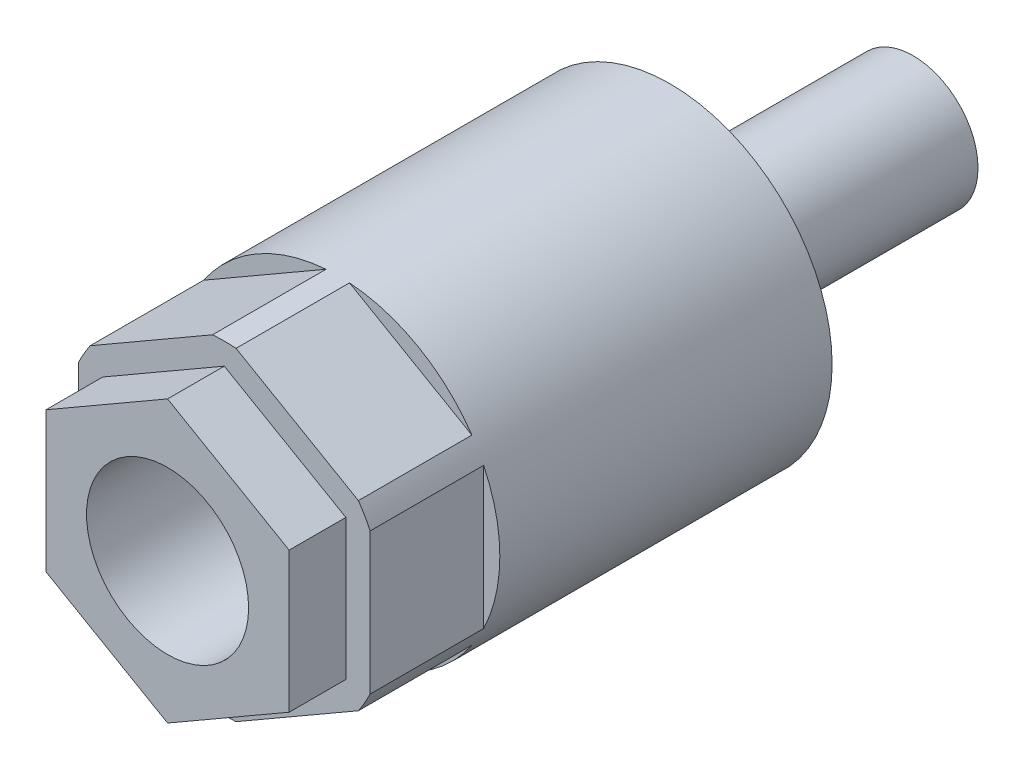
ISO-10303-21;
HEADER;
FILE_DESCRIPTION(('STEP AP214'),'2;1');
FILE_NAME('part.step','',(''),(''),'','','');
FILE_SCHEMA(('AUTOMOTIVE_DESIGN { 1 0 10303 214 1 1 1 1 }'));
ENDSEC;
DATA;
#1=APPLICATION_CONTEXT('core data for automotive mechanical design processes');
#2=APPLICATION_PROTOCOL_DEFINITION('international standard','automotive_design',2000,#1);
#3=PRODUCT_CONTEXT('',#1,'mechanical');
#4=PRODUCT('Part','Part','',(#3));
#5=PRODUCT_RELATED_PRODUCT_CATEGORY('part','',(#4));
#6=PRODUCT_DEFINITION_FORMATION('','',#4);
#7=PRODUCT_DEFINITION_CONTEXT('part definition',#1,'design');
#8=PRODUCT_DEFINITION('design','',#6,#7);
#9=PRODUCT_DEFINITION_SHAPE('','',#8);
#10=(LENGTH_UNIT() NAMED_UNIT(*) SI_UNIT(.MILLI.,.METRE.));
#11=(NAMED_UNIT(*) PLANE_ANGLE_UNIT() SI_UNIT($,.RADIAN.));
#12=(NAMED_UNIT(*) SI_UNIT($,.STERADIAN.) SOLID_ANGLE_UNIT());
#13=UNCERTAINTY_MEASURE_WITH_UNIT(LENGTH_MEASURE(1.E-05),#10,'distance_accuracy_value','');
#14=(GEOMETRIC_REPRESENTATION_CONTEXT(3) GLOBAL_UNCERTAINTY_ASSIGNED_CONTEXT((#13)) GLOBAL_UNIT_ASSIGNED_CONTEXT((#10,
#11,#12)) REPRESENTATION_CONTEXT('',''));
#15=CARTESIAN_POINT('',(0.,0.,0.));
#16=DIRECTION('',(0.,0.,1.));
#17=DIRECTION('',(1.,0.,0.));
#18=AXIS2_PLACEMENT_3D('',#15,#16,#17);
#19=CARTESIAN_POINT('',(0.,0.,80.));
#20=DIRECTION('',(0.,0.,1.));
#21=DIRECTION('',(1.,0.,0.));
#22=AXIS2_PLACEMENT_3D('',#19,#20,#21);
#23=CYLINDRICAL_SURFACE('',#22,20.);
#24=CARTESIAN_POINT('',(0.,0.,0.));
#25=DIRECTION('',(0.,0.,1.));
#26=DIRECTION('',(1.,0.,0.));
#27=AXIS2_PLACEMENT_3D('',#24,#25,#26);
#28=CIRCLE('',#27,20.);
#29=CARTESIAN_POINT('',(20.,0.,0.));
#30=VERTEX_POINT('',#29);
#31=EDGE_CURVE('E239',#30,#30,#28,.T.);
#32=ORIENTED_EDGE('',*,*,#31,.T.);
#33=EDGE_LOOP('',(#32));
#34=FACE_BOUND('',#33,.T.);
#35=DIRECTION('',(0.,0.,1.));
#36=VECTOR('',#35,1.);
#37=CARTESIAN_POINT('',(18.,-8.71779788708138,80.));
#38=LINE('',#37,#36);
#39=CARTESIAN_POINT('',(18.,-8.71779788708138,41.));
#40=VERTEX_POINT('',#39);
#41=CARTESIAN_POINT('',(18.,-8.71779788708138,55.));
#42=VERTEX_POINT('',#41);
#43=EDGE_CURVE('E269',#40,#42,#38,.T.);
#44=ORIENTED_EDGE('',*,*,#43,.T.);
#45=CARTESIAN_POINT('',(0.,0.,55.));
#46=DIRECTION('',(0.,0.,1.));
#47=DIRECTION('',(1.,0.,0.));
#48=AXIS2_PLACEMENT_3D('',#45,#46,#47);
#49=CIRCLE('',#48,20.);
#50=CARTESIAN_POINT('',(16.5498344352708,-11.2295583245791,55.));
#51=VERTEX_POINT('',#50);
#52=EDGE_CURVE('E206',#42,#51,#49,.F.);
#53=ORIENTED_EDGE('',*,*,#52,.T.);
#54=DIRECTION('',(0.,0.,1.));
#55=VECTOR('',#54,1.);
#56=CARTESIAN_POINT('',(16.5498344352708,-11.2295583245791,80.));
#57=LINE('',#56,#55);
#58=CARTESIAN_POINT('',(16.5498344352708,-11.2295583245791,41.));
#59=VERTEX_POINT('',#58);
#60=EDGE_CURVE('E263',#59,#51,#57,.T.);
#61=ORIENTED_EDGE('',*,*,#60,.F.);
#62=CARTESIAN_POINT('',(0.,0.,41.));
#63=DIRECTION('',(0.,0.,1.));
#64=DIRECTION('',(1.,0.,0.));
#65=AXIS2_PLACEMENT_3D('',#62,#63,#64);
#66=CIRCLE('',#65,20.);
#67=CARTESIAN_POINT('',(1.45016556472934,-19.9473562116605,41.));
#68=VERTEX_POINT('',#67);
#69=EDGE_CURVE('E266',#59,#68,#66,.F.);
#70=ORIENTED_EDGE('',*,*,#69,.T.);
#71=DIRECTION('',(0.,0.,1.));
#72=VECTOR('',#71,1.);
#73=CARTESIAN_POINT('',(1.45016556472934,-19.9473562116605,80.));
#74=LINE('',#73,#72);
#75=CARTESIAN_POINT('',(1.45016556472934,-19.9473562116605,55.));
#76=VERTEX_POINT('',#75);
#77=EDGE_CURVE('E267',#76,#68,#74,.F.);
#78=ORIENTED_EDGE('',*,*,#77,.F.);
#79=CARTESIAN_POINT('',(-1.45016556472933,-19.9473562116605,55.));
#80=VERTEX_POINT('',#79);
#81=EDGE_CURVE('E196',#76,#80,#49,.F.);
#82=ORIENTED_EDGE('',*,*,#81,.T.);
#83=DIRECTION('',(0.,0.,1.));
#84=VECTOR('',#83,1.);
#85=CARTESIAN_POINT('',(-1.45016556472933,-19.9473562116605,80.));
#86=LINE('',#85,#84);
#87=CARTESIAN_POINT('',(-1.45016556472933,-19.9473562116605,41.));
#88=VERTEX_POINT('',#87);
#89=EDGE_CURVE('E261',#80,#88,#86,.F.);
#90=ORIENTED_EDGE('',*,*,#89,.T.);
#91=CARTESIAN_POINT('',(-16.5498344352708,-11.2295583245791,41.));
#92=VERTEX_POINT('',#91);
#93=EDGE_CURVE('E260',#88,#92,#66,.F.);
#94=ORIENTED_EDGE('',*,*,#93,.T.);
#95=DIRECTION('',(0.,0.,1.));
#96=VECTOR('',#95,1.);
#97=CARTESIAN_POINT('',(-16.5498344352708,-11.2295583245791,80.));
#98=LINE('',#97,#96);
#99=CARTESIAN_POINT('',(-16.5498344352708,-11.2295583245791,55.));
#100=VERTEX_POINT('',#99);
#101=EDGE_CURVE('E257',#92,#100,#98,.T.);
#102=ORIENTED_EDGE('',*,*,#101,.T.);
#103=CARTESIAN_POINT('',(-18.,-8.71779788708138,55.));
#104=VERTEX_POINT('',#103);
#105=EDGE_CURVE('E208',#100,#104,#49,.F.);
#106=ORIENTED_EDGE('',*,*,#105,.T.);
#107=DIRECTION('',(0.,0.,1.));
#108=VECTOR('',#107,1.);
#109=CARTESIAN_POINT('',(-18.,-8.71779788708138,80.));
#110=LINE('',#109,#108);
#111=CARTESIAN_POINT('',(-18.,-8.71779788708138,41.));
#112=VERTEX_POINT('',#111);
#113=EDGE_CURVE('E252',#112,#104,#110,.T.);
#114=ORIENTED_EDGE('',*,*,#113,.F.);
#115=CARTESIAN_POINT('',(-18.,8.71779788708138,41.));
#116=VERTEX_POINT('',#115);
#117=EDGE_CURVE('E250',#112,#116,#66,.F.);
#118=ORIENTED_EDGE('',*,*,#117,.T.);
#119=DIRECTION('',(0.,0.,1.));
#120=VECTOR('',#119,1.);
#121=CARTESIAN_POINT('',(-18.,8.71779788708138,80.));
#122=LINE('',#121,#120);
#123=CARTESIAN_POINT('',(-18.,8.71779788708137,55.));
#124=VERTEX_POINT('',#123);
#125=EDGE_CURVE('E255',#124,#116,#122,.F.);
#126=ORIENTED_EDGE('',*,*,#125,.F.);
#127=CARTESIAN_POINT('',(-16.5498344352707,11.2295583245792,55.));
#128=VERTEX_POINT('',#127);
#129=EDGE_CURVE('E202',#124,#128,#49,.F.);
#130=ORIENTED_EDGE('',*,*,#129,.T.);
#131=DIRECTION('',(0.,0.,1.));
#132=VECTOR('',#131,1.);
#133=CARTESIAN_POINT('',(-16.5498344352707,11.2295583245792,80.));
#134=LINE('',#133,#132);
#135=CARTESIAN_POINT('',(-16.5498344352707,11.2295583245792,41.));
#136=VERTEX_POINT('',#135);
#137=EDGE_CURVE('E242',#136,#128,#134,.T.);
#138=ORIENTED_EDGE('',*,*,#137,.F.);
#139=CARTESIAN_POINT('',(-1.45016556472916,19.9473562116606,41.));
#140=VERTEX_POINT('',#139);
#141=EDGE_CURVE('E245',#136,#140,#66,.F.);
#142=ORIENTED_EDGE('',*,*,#141,.T.);
#143=DIRECTION('',(0.,0.,1.));
#144=VECTOR('',#143,1.);
#145=CARTESIAN_POINT('',(-1.45016556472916,19.9473562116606,80.));
#146=LINE('',#145,#144);
#147=CARTESIAN_POINT('',(-1.45016556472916,19.9473562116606,55.));
#148=VERTEX_POINT('',#147);
#149=EDGE_CURVE('E248',#148,#140,#146,.F.);
#150=ORIENTED_EDGE('',*,*,#149,.F.);
#151=CARTESIAN_POINT('',(1.45016556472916,19.9473562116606,55.));
#152=VERTEX_POINT('',#151);
#153=EDGE_CURVE('E195',#148,#152,#49,.F.);
#154=ORIENTED_EDGE('',*,*,#153,.T.);
#155=DIRECTION('',(0.,0.,1.));
#156=VECTOR('',#155,1.);
#157=CARTESIAN_POINT('',(1.45016556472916,19.9473562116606,80.));
#158=LINE('',#157,#156);
#159=CARTESIAN_POINT('',(1.45016556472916,19.9473562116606,41.));
#160=VERTEX_POINT('',#159);
#161=EDGE_CURVE('E23',#152,#160,#158,.F.);
#162=ORIENTED_EDGE('',*,*,#161,.T.);
#163=CARTESIAN_POINT('',(16.5498344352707,11.2295583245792,41.));
#164=VERTEX_POINT('',#163);
#165=EDGE_CURVE('E249',#160,#164,#66,.F.);
#166=ORIENTED_EDGE('',*,*,#165,.T.);
#167=DIRECTION('',(0.,0.,1.));
#168=VECTOR('',#167,1.);
#169=CARTESIAN_POINT('',(16.5498344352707,11.2295583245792,80.));
#170=LINE('',#169,#168);
#171=CARTESIAN_POINT('',(16.5498344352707,11.2295583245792,55.));
#172=VERTEX_POINT('',#171);
#173=EDGE_CURVE('E275',#164,#172,#170,.T.);
#174=ORIENTED_EDGE('',*,*,#173,.T.);
#175=CARTESIAN_POINT('',(18.,8.71779788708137,55.));
#176=VERTEX_POINT('',#175);
#177=EDGE_CURVE('E38',#172,#176,#49,.F.);
#178=ORIENTED_EDGE('',*,*,#177,.T.);
#179=DIRECTION('',(0.,0.,1.));
#180=VECTOR('',#179,1.);
#181=CARTESIAN_POINT('',(18.,8.71779788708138,80.));
#182=LINE('',#181,#180);
#183=CARTESIAN_POINT('',(18.,8.71779788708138,41.));
#184=VERTEX_POINT('',#183);
#185=EDGE_CURVE('E273',#176,#184,#182,.F.);
#186=ORIENTED_EDGE('',*,*,#185,.T.);
#187=EDGE_CURVE('E272',#184,#40,#66,.F.);
#188=ORIENTED_EDGE('',*,*,#187,.T.);
#189=EDGE_LOOP('',(#44,#53,#61,#70,#78,#82,#90,#94,#102,#106,#114,#118,#126,#130,#138,#142,#150,
#154,#162,#166,#174,#178,#186,#188));
#190=FACE_BOUND('',#189,.T.);
#191=ADVANCED_FACE('F14',(#34,#190),#23,.T.);
#192=CARTESIAN_POINT('',(-18.,10.3923048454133,41.));
#193=DIRECTION('',(0.5,-0.86602540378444,0.));
#194=DIRECTION('',(0.86602540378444,0.5,0.));
#195=AXIS2_PLACEMENT_3D('',#192,#193,#194);
#196=PLANE('',#195);
#197=DIRECTION('',(-0.86602540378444,-0.5,0.));
#198=VECTOR('',#197,1.);
#199=CARTESIAN_POINT('',(-18.,10.3923048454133,55.));
#200=LINE('',#199,#198);
#201=EDGE_CURVE('E200',#148,#128,#200,.T.);
#202=ORIENTED_EDGE('',*,*,#201,.F.);
#203=ORIENTED_EDGE('',*,*,#149,.T.);
#204=DIRECTION('',(0.86602540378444,0.5,0.));
#205=VECTOR('',#204,1.);
#206=CARTESIAN_POINT('',(-18.,10.3923048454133,41.));
#207=LINE('',#206,#205);
#208=EDGE_CURVE('E226',#136,#140,#207,.T.);
#209=ORIENTED_EDGE('',*,*,#208,.F.);
#210=ORIENTED_EDGE('',*,*,#137,.T.);
#211=EDGE_LOOP('',(#202,#203,#209,#210));
#212=FACE_BOUND('',#211,.T.);
#213=ADVANCED_FACE('F333',(#212),#196,.F.);
#214=CARTESIAN_POINT('',(-18.,-10.3923048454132,41.));
#215=DIRECTION('',(1.,0.,0.));
#216=DIRECTION('',(0.,0.,-1.));
#217=AXIS2_PLACEMENT_3D('',#214,#215,#216);
#218=PLANE('',#217);
#219=DIRECTION('',(0.,-1.,0.));
#220=VECTOR('',#219,1.);
#221=CARTESIAN_POINT('',(-18.,-10.3923048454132,55.));
#222=LINE('',#221,#220);
#223=EDGE_CURVE('E205',#124,#104,#222,.T.);
#224=ORIENTED_EDGE('',*,*,#223,.F.);
#225=ORIENTED_EDGE('',*,*,#125,.T.);
#226=DIRECTION('',(0.,1.,0.));
#227=VECTOR('',#226,1.);
#228=CARTESIAN_POINT('',(-18.,-10.3923048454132,41.));
#229=LINE('',#228,#227);
#230=EDGE_CURVE('E223',#112,#116,#229,.T.);
#231=ORIENTED_EDGE('',*,*,#230,.F.);
#232=ORIENTED_EDGE('',*,*,#113,.T.);
#233=EDGE_LOOP('',(#224,#225,#231,#232));
#234=FACE_BOUND('',#233,.T.);
#235=ADVANCED_FACE('F301',(#234),#218,.F.);
#236=CARTESIAN_POINT('',(-18.,-10.3923048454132,41.));
#237=DIRECTION('',(-0.5,-0.866025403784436,0.));
#238=DIRECTION('',(0.866025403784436,-0.5,0.));
#239=AXIS2_PLACEMENT_3D('',#236,#237,#238);
#240=PLANE('',#239);
#241=ORIENTED_EDGE('',*,*,#89,.F.);
#242=DIRECTION('',(-0.866025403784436,0.5,0.));
#243=VECTOR('',#242,1.);
#244=CARTESIAN_POINT('',(-18.,-10.3923048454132,55.));
#245=LINE('',#244,#243);
#246=EDGE_CURVE('E209',#80,#100,#245,.T.);
#247=ORIENTED_EDGE('',*,*,#246,.T.);
#248=ORIENTED_EDGE('',*,*,#101,.F.);
#249=DIRECTION('',(0.866025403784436,-0.5,0.));
#250=VECTOR('',#249,1.);
#251=CARTESIAN_POINT('',(-18.,-10.3923048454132,41.));
#252=LINE('',#251,#250);
#253=EDGE_CURVE('E220',#92,#88,#252,.T.);
#254=ORIENTED_EDGE('',*,*,#253,.T.);
#255=EDGE_LOOP('',(#241,#247,#248,#254));
#256=FACE_BOUND('',#255,.T.);
#257=ADVANCED_FACE('F398',(#256),#240,.T.);
#258=CARTESIAN_POINT('',(18.,-10.3923048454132,41.));
#259=DIRECTION('',(-0.5,0.866025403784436,0.));
#260=DIRECTION('',(-0.866025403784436,-0.5,0.));
#261=AXIS2_PLACEMENT_3D('',#258,#259,#260);
#262=PLANE('',#261);
#263=DIRECTION('',(0.866025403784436,0.5,0.));
#264=VECTOR('',#263,1.);
#265=CARTESIAN_POINT('',(18.,-10.3923048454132,55.));
#266=LINE('',#265,#264);
#267=EDGE_CURVE('E203',#76,#51,#266,.T.);
#268=ORIENTED_EDGE('',*,*,#267,.F.);
#269=ORIENTED_EDGE('',*,*,#77,.T.);
#270=DIRECTION('',(-0.866025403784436,-0.5,0.));
#271=VECTOR('',#270,1.);
#272=CARTESIAN_POINT('',(18.,-10.3923048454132,41.));
#273=LINE('',#272,#271);
#274=EDGE_CURVE('E217',#59,#68,#273,.T.);
#275=ORIENTED_EDGE('',*,*,#274,.F.);
#276=ORIENTED_EDGE('',*,*,#60,.T.);
#277=EDGE_LOOP('',(#268,#269,#275,#276));
#278=FACE_BOUND('',#277,.T.);
#279=ADVANCED_FACE('F401',(#278),#262,.F.);
#280=CARTESIAN_POINT('',(18.,-10.3923048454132,41.));
#281=DIRECTION('',(1.,0.,0.));
#282=DIRECTION('',(0.,0.,-1.));
#283=AXIS2_PLACEMENT_3D('',#280,#281,#282);
#284=PLANE('',#283);
#285=ORIENTED_EDGE('',*,*,#185,.F.);
#286=DIRECTION('',(0.,-1.,0.));
#287=VECTOR('',#286,1.);
#288=CARTESIAN_POINT('',(18.,-10.3923048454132,55.));
#289=LINE('',#288,#287);
#290=EDGE_CURVE('E197',#176,#42,#289,.T.);
#291=ORIENTED_EDGE('',*,*,#290,.T.);
#292=ORIENTED_EDGE('',*,*,#43,.F.);
#293=DIRECTION('',(0.,1.,0.));
#294=VECTOR('',#293,1.);
#295=CARTESIAN_POINT('',(18.,-10.3923048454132,41.));
#296=LINE('',#295,#294);
#297=EDGE_CURVE('E213',#40,#184,#296,.T.);
#298=ORIENTED_EDGE('',*,*,#297,.T.);
#299=EDGE_LOOP('',(#285,#291,#292,#298));
#300=FACE_BOUND('',#299,.T.);
#301=ADVANCED_FACE('F394',(#300),#284,.T.);
#302=CARTESIAN_POINT('',(18.,10.3923048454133,41.));
#303=DIRECTION('',(0.5,0.86602540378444,0.));
#304=DIRECTION('',(-0.86602540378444,0.5,0.));
#305=AXIS2_PLACEMENT_3D('',#302,#303,#304);
#306=PLANE('',#305);
#307=ORIENTED_EDGE('',*,*,#161,.F.);
#308=DIRECTION('',(0.86602540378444,-0.5,0.));
#309=VECTOR('',#308,1.);
#310=CARTESIAN_POINT('',(18.,10.3923048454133,55.));
#311=LINE('',#310,#309);
#312=EDGE_CURVE('E9',#152,#172,#311,.T.);
#313=ORIENTED_EDGE('',*,*,#312,.T.);
#314=ORIENTED_EDGE('',*,*,#173,.F.);
#315=DIRECTION('',(-0.86602540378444,0.5,0.));
#316=VECTOR('',#315,1.);
#317=CARTESIAN_POINT('',(18.,10.3923048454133,41.));
#318=LINE('',#317,#316);
#319=EDGE_CURVE('E212',#164,#160,#318,.T.);
#320=ORIENTED_EDGE('',*,*,#319,.T.);
#321=EDGE_LOOP('',(#307,#313,#314,#320));
#322=FACE_BOUND('',#321,.T.);
#323=ADVANCED_FACE('F310',(#322),#306,.T.);
#324=CARTESIAN_POINT('',(20.,0.,0.));
#325=DIRECTION('',(0.,0.,-1.));
#326=DIRECTION('',(-1.,0.,0.));
#327=AXIS2_PLACEMENT_3D('',#324,#325,#326);
#328=PLANE('',#327);
#329=CARTESIAN_POINT('',(0.,0.,0.));
#330=DIRECTION('',(0.,0.,1.));
#331=DIRECTION('',(1.,0.,0.));
#332=AXIS2_PLACEMENT_3D('',#329,#330,#331);
#333=CIRCLE('',#332,8.);
#334=CARTESIAN_POINT('',(8.,0.,0.));
#335=VERTEX_POINT('',#334);
#336=EDGE_CURVE('E236',#335,#335,#333,.T.);
#337=ORIENTED_EDGE('',*,*,#336,.T.);
#338=EDGE_LOOP('',(#337));
#339=FACE_BOUND('',#338,.T.);
#340=ORIENTED_EDGE('',*,*,#31,.F.);
#341=EDGE_LOOP('',(#340));
#342=FACE_BOUND('',#341,.T.);
#343=ADVANCED_FACE('F342',(#339,#342),#328,.T.);
#344=CARTESIAN_POINT('',(0.,0.,80.));
#345=DIRECTION('',(0.,0.,1.));
#346=DIRECTION('',(1.,0.,0.));
#347=AXIS2_PLACEMENT_3D('',#344,#345,#346);
#348=CYLINDRICAL_SURFACE('',#347,8.);
#349=CARTESIAN_POINT('',(0.,0.,-30.));
#350=DIRECTION('',(0.,0.,1.));
#351=DIRECTION('',(0.,-1.,0.));
#352=AXIS2_PLACEMENT_3D('',#349,#350,#351);
#353=CIRCLE('',#352,8.);
#354=CARTESIAN_POINT('',(0.,-8.,-30.));
#355=VERTEX_POINT('',#354);
#356=EDGE_CURVE('E18',#355,#355,#353,.F.);
#357=ORIENTED_EDGE('',*,*,#356,.F.);
#358=EDGE_LOOP('',(#357));
#359=FACE_BOUND('',#358,.T.);
#360=ORIENTED_EDGE('',*,*,#336,.F.);
#361=EDGE_LOOP('',(#360));
#362=FACE_BOUND('',#361,.T.);
#363=ADVANCED_FACE('F330',(#359,#362),#348,.T.);
#364=CARTESIAN_POINT('',(0.,0.,41.));
#365=DIRECTION('',(0.,0.,1.));
#366=DIRECTION('',(1.,0.,0.));
#367=AXIS2_PLACEMENT_3D('',#364,#365,#366);
#368=PLANE('',#367);
#369=ORIENTED_EDGE('',*,*,#208,.T.);
#370=ORIENTED_EDGE('',*,*,#141,.F.);
#371=EDGE_LOOP('',(#369,#370));
#372=FACE_BOUND('',#371,.T.);
#373=ADVANCED_FACE('F317',(#372),#368,.T.);
#374=ORIENTED_EDGE('',*,*,#230,.T.);
#375=ORIENTED_EDGE('',*,*,#117,.F.);
#376=EDGE_LOOP('',(#374,#375));
#377=FACE_BOUND('',#376,.T.);
#378=ADVANCED_FACE('F298',(#377),#368,.T.);
#379=ORIENTED_EDGE('',*,*,#253,.F.);
#380=ORIENTED_EDGE('',*,*,#93,.F.);
#381=EDGE_LOOP('',(#379,#380));
#382=FACE_BOUND('',#381,.T.);
#383=ADVANCED_FACE('F416',(#382),#368,.T.);
#384=ORIENTED_EDGE('',*,*,#274,.T.);
#385=ORIENTED_EDGE('',*,*,#69,.F.);
#386=EDGE_LOOP('',(#384,#385));
#387=FACE_BOUND('',#386,.T.);
#388=ADVANCED_FACE('F325',(#387),#368,.T.);
#389=ORIENTED_EDGE('',*,*,#297,.F.);
#390=ORIENTED_EDGE('',*,*,#187,.F.);
#391=EDGE_LOOP('',(#389,#390));
#392=FACE_BOUND('',#391,.T.);
#393=ADVANCED_FACE('F315',(#392),#368,.T.);
#394=ORIENTED_EDGE('',*,*,#319,.F.);
#395=ORIENTED_EDGE('',*,*,#165,.F.);
#396=EDGE_LOOP('',(#394,#395));
#397=FACE_BOUND('',#396,.T.);
#398=ADVANCED_FACE('F313',(#397),#368,.T.);
#399=CARTESIAN_POINT('',(0.,0.,55.));
#400=DIRECTION('',(0.,0.,1.));
#401=DIRECTION('',(1.,0.,0.));
#402=AXIS2_PLACEMENT_3D('',#399,#400,#401);
#403=PLANE('',#402);
#404=ORIENTED_EDGE('',*,*,#81,.F.);
#405=ORIENTED_EDGE('',*,*,#267,.T.);
#406=ORIENTED_EDGE('',*,*,#52,.F.);
#407=ORIENTED_EDGE('',*,*,#290,.F.);
#408=ORIENTED_EDGE('',*,*,#177,.F.);
#409=ORIENTED_EDGE('',*,*,#312,.F.);
#410=ORIENTED_EDGE('',*,*,#153,.F.);
#411=ORIENTED_EDGE('',*,*,#201,.T.);
#412=ORIENTED_EDGE('',*,*,#129,.F.);
#413=ORIENTED_EDGE('',*,*,#223,.T.);
#414=ORIENTED_EDGE('',*,*,#105,.F.);
#415=ORIENTED_EDGE('',*,*,#246,.F.);
#416=EDGE_LOOP('',(#404,#405,#406,#407,#408,#409,#410,#411,#412,#413,#414,#415));
#417=FACE_BOUND('',#416,.T.);
#418=DIRECTION('',(-0.866025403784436,-0.5,0.));
#419=VECTOR('',#418,1.);
#420=CARTESIAN_POINT('',(15.,-8.66025403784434,55.));
#421=LINE('',#420,#419);
#422=CARTESIAN_POINT('',(15.,-8.66025403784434,55.));
#423=VERTEX_POINT('',#422);
#424=CARTESIAN_POINT('',(0.,-17.3205080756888,55.));
#425=VERTEX_POINT('',#424);
#426=EDGE_CURVE('E183',#423,#425,#421,.T.);
#427=ORIENTED_EDGE('',*,*,#426,.T.);
#428=DIRECTION('',(0.866025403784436,-0.5,0.));
#429=VECTOR('',#428,1.);
#430=CARTESIAN_POINT('',(-15.,-8.66025403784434,55.));
#431=LINE('',#430,#429);
#432=CARTESIAN_POINT('',(-15.,-8.66025403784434,55.));
#433=VERTEX_POINT('',#432);
#434=EDGE_CURVE('E147',#433,#425,#431,.T.);
#435=ORIENTED_EDGE('',*,*,#434,.F.);
#436=DIRECTION('',(0.,1.,0.));
#437=VECTOR('',#436,1.);
#438=CARTESIAN_POINT('',(-15.,-8.66025403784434,55.));
#439=LINE('',#438,#437);
#440=CARTESIAN_POINT('',(-15.,8.66025403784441,55.));
#441=VERTEX_POINT('',#440);
#442=EDGE_CURVE('E179',#433,#441,#439,.T.);
#443=ORIENTED_EDGE('',*,*,#442,.T.);
#444=DIRECTION('',(0.866025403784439,0.5,0.));
#445=VECTOR('',#444,1.);
#446=CARTESIAN_POINT('',(-15.,8.66025403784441,55.));
#447=LINE('',#446,#445);
#448=CARTESIAN_POINT('',(0.,17.3205080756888,55.));
#449=VERTEX_POINT('',#448);
#450=EDGE_CURVE('E176',#441,#449,#447,.T.);
#451=ORIENTED_EDGE('',*,*,#450,.T.);
#452=DIRECTION('',(-0.866025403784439,0.5,0.));
#453=VECTOR('',#452,1.);
#454=CARTESIAN_POINT('',(15.,8.66025403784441,55.));
#455=LINE('',#454,#453);
#456=CARTESIAN_POINT('',(15.,8.66025403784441,55.));
#457=VERTEX_POINT('',#456);
#458=EDGE_CURVE('E173',#457,#449,#455,.T.);
#459=ORIENTED_EDGE('',*,*,#458,.F.);
#460=DIRECTION('',(0.,1.,0.));
#461=VECTOR('',#460,1.);
#462=CARTESIAN_POINT('',(15.,-8.66025403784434,55.));
#463=LINE('',#462,#461);
#464=EDGE_CURVE('E170',#423,#457,#463,.T.);
#465=ORIENTED_EDGE('',*,*,#464,.F.);
#466=EDGE_LOOP('',(#427,#435,#443,#451,#459,#465));
#467=FACE_BOUND('',#466,.T.);
#468=ADVANCED_FACE('F302',(#417,#467),#403,.T.);
#469=CARTESIAN_POINT('',(15.,-8.66025403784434,55.));
#470=DIRECTION('',(-0.5,0.866025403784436,0.));
#471=DIRECTION('',(-0.866025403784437,-0.5,0.));
#472=AXIS2_PLACEMENT_3D('',#469,#470,#471);
#473=PLANE('',#472);
#474=DIRECTION('',(0.,0.,1.));
#475=VECTOR('',#474,1.);
#476=CARTESIAN_POINT('',(0.,-17.3205080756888,55.));
#477=LINE('',#476,#475);
#478=CARTESIAN_POINT('',(0.,-17.3205080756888,62.));
#479=VERTEX_POINT('',#478);
#480=EDGE_CURVE('E140',#425,#479,#477,.T.);
#481=ORIENTED_EDGE('',*,*,#480,.F.);
#482=ORIENTED_EDGE('',*,*,#426,.F.);
#483=DIRECTION('',(0.,0.,1.));
#484=VECTOR('',#483,1.);
#485=CARTESIAN_POINT('',(15.,-8.66025403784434,55.));
#486=LINE('',#485,#484);
#487=CARTESIAN_POINT('',(15.,-8.66025403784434,62.));
#488=VERTEX_POINT('',#487);
#489=EDGE_CURVE('E156',#423,#488,#486,.T.);
#490=ORIENTED_EDGE('',*,*,#489,.T.);
#491=DIRECTION('',(-0.866025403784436,-0.5,0.));
#492=VECTOR('',#491,1.);
#493=CARTESIAN_POINT('',(15.,-8.66025403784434,62.));
#494=LINE('',#493,#492);
#495=EDGE_CURVE('E154',#488,#479,#494,.T.);
#496=ORIENTED_EDGE('',*,*,#495,.T.);
#497=EDGE_LOOP('',(#481,#482,#490,#496));
#498=FACE_BOUND('',#497,.T.);
#499=ADVANCED_FACE('F155',(#498),#473,.F.);
#500=CARTESIAN_POINT('',(-15.,-8.66025403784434,55.));
#501=DIRECTION('',(-0.5,-0.866025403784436,0.));
#502=DIRECTION('',(0.866025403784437,-0.5,0.));
#503=AXIS2_PLACEMENT_3D('',#500,#501,#502);
#504=PLANE('',#503);
#505=DIRECTION('',(0.,0.,1.));
#506=VECTOR('',#505,1.);
#507=CARTESIAN_POINT('',(-15.,-8.66025403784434,55.));
#508=LINE('',#507,#506);
#509=CARTESIAN_POINT('',(-15.,-8.66025403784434,62.));
#510=VERTEX_POINT('',#509);
#511=EDGE_CURVE('E151',#433,#510,#508,.T.);
#512=ORIENTED_EDGE('',*,*,#511,.F.);
#513=ORIENTED_EDGE('',*,*,#434,.T.);
#514=ORIENTED_EDGE('',*,*,#480,.T.);
#515=DIRECTION('',(0.866025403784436,-0.5,0.));
#516=VECTOR('',#515,1.);
#517=CARTESIAN_POINT('',(-15.,-8.66025403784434,62.));
#518=LINE('',#517,#516);
#519=EDGE_CURVE('E144',#510,#479,#518,.T.);
#520=ORIENTED_EDGE('',*,*,#519,.F.);
#521=EDGE_LOOP('',(#512,#513,#514,#520));
#522=FACE_BOUND('',#521,.T.);
#523=ADVANCED_FACE('F142',(#522),#504,.T.);
#524=CARTESIAN_POINT('',(-15.,-8.66025403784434,55.));
#525=DIRECTION('',(1.,0.,0.));
#526=DIRECTION('',(0.,0.,-1.));
#527=AXIS2_PLACEMENT_3D('',#524,#525,#526);
#528=PLANE('',#527);
#529=DIRECTION('',(0.,0.,1.));
#530=VECTOR('',#529,1.);
#531=CARTESIAN_POINT('',(-15.,8.66025403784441,55.));
#532=LINE('',#531,#530);
#533=CARTESIAN_POINT('',(-15.,8.66025403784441,62.));
#534=VERTEX_POINT('',#533);
#535=EDGE_CURVE('E191',#441,#534,#532,.T.);
#536=ORIENTED_EDGE('',*,*,#535,.F.);
#537=ORIENTED_EDGE('',*,*,#442,.F.);
#538=ORIENTED_EDGE('',*,*,#511,.T.);
#539=DIRECTION('',(0.,1.,0.));
#540=VECTOR('',#539,1.);
#541=CARTESIAN_POINT('',(-15.,-8.66025403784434,62.));
#542=LINE('',#541,#540);
#543=EDGE_CURVE('E164',#510,#534,#542,.T.);
#544=ORIENTED_EDGE('',*,*,#543,.T.);
#545=EDGE_LOOP('',(#536,#537,#538,#544));
#546=FACE_BOUND('',#545,.T.);
#547=ADVANCED_FACE('F386',(#546),#528,.F.);
#548=CARTESIAN_POINT('',(-15.,8.66025403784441,55.));
#549=DIRECTION('',(0.5,-0.86602540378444,0.));
#550=DIRECTION('',(0.86602540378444,0.5,0.));
#551=AXIS2_PLACEMENT_3D('',#548,#549,#550);
#552=PLANE('',#551);
#553=DIRECTION('',(0.,0.,1.));
#554=VECTOR('',#553,1.);
#555=CARTESIAN_POINT('',(0.,17.3205080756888,55.));
#556=LINE('',#555,#554);
#557=CARTESIAN_POINT('',(0.,17.3205080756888,62.));
#558=VERTEX_POINT('',#557);
#559=EDGE_CURVE('E189',#449,#558,#556,.T.);
#560=ORIENTED_EDGE('',*,*,#559,.F.);
#561=ORIENTED_EDGE('',*,*,#450,.F.);
#562=ORIENTED_EDGE('',*,*,#535,.T.);
#563=DIRECTION('',(0.866025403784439,0.5,0.));
#564=VECTOR('',#563,1.);
#565=CARTESIAN_POINT('',(-15.,8.66025403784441,62.));
#566=LINE('',#565,#564);
#567=EDGE_CURVE('E166',#534,#558,#566,.T.);
#568=ORIENTED_EDGE('',*,*,#567,.T.);
#569=EDGE_LOOP('',(#560,#561,#562,#568));
#570=FACE_BOUND('',#569,.T.);
#571=ADVANCED_FACE('F383',(#570),#552,.F.);
#572=CARTESIAN_POINT('',(15.,8.66025403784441,55.));
#573=DIRECTION('',(0.5,0.866025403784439,0.));
#574=DIRECTION('',(-0.86602540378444,0.5,0.));
#575=AXIS2_PLACEMENT_3D('',#572,#573,#574);
#576=PLANE('',#575);
#577=DIRECTION('',(0.,0.,1.));
#578=VECTOR('',#577,1.);
#579=CARTESIAN_POINT('',(15.,8.66025403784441,55.));
#580=LINE('',#579,#578);
#581=CARTESIAN_POINT('',(15.,8.66025403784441,62.));
#582=VERTEX_POINT('',#581);
#583=EDGE_CURVE('E187',#457,#582,#580,.T.);
#584=ORIENTED_EDGE('',*,*,#583,.F.);
#585=ORIENTED_EDGE('',*,*,#458,.T.);
#586=ORIENTED_EDGE('',*,*,#559,.T.);
#587=DIRECTION('',(-0.866025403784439,0.5,0.));
#588=VECTOR('',#587,1.);
#589=CARTESIAN_POINT('',(15.,8.66025403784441,62.));
#590=LINE('',#589,#588);
#591=EDGE_CURVE('E30',#582,#558,#590,.T.);
#592=ORIENTED_EDGE('',*,*,#591,.F.);
#593=EDGE_LOOP('',(#584,#585,#586,#592));
#594=FACE_BOUND('',#593,.T.);
#595=ADVANCED_FACE('F379',(#594),#576,.T.);
#596=CARTESIAN_POINT('',(15.,-8.66025403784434,55.));
#597=DIRECTION('',(1.,0.,0.));
#598=DIRECTION('',(0.,0.,-1.));
#599=AXIS2_PLACEMENT_3D('',#596,#597,#598);
#600=PLANE('',#599);
#601=ORIENTED_EDGE('',*,*,#464,.T.);
#602=ORIENTED_EDGE('',*,*,#583,.T.);
#603=DIRECTION('',(0.,1.,0.));
#604=VECTOR('',#603,1.);
#605=CARTESIAN_POINT('',(15.,-8.66025403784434,62.));
#606=LINE('',#605,#604);
#607=EDGE_CURVE('E185',#488,#582,#606,.T.);
#608=ORIENTED_EDGE('',*,*,#607,.F.);
#609=ORIENTED_EDGE('',*,*,#489,.F.);
#610=EDGE_LOOP('',(#601,#602,#608,#609));
#611=FACE_BOUND('',#610,.T.);
#612=ADVANCED_FACE('F352',(#611),#600,.T.);
#613=CARTESIAN_POINT('',(10.,0.,6.));
#614=DIRECTION('',(0.,0.,-1.));
#615=DIRECTION('',(-1.,0.,0.));
#616=AXIS2_PLACEMENT_3D('',#613,#614,#615);
#617=PLANE('',#616);
#618=CARTESIAN_POINT('',(0.,0.,6.));
#619=DIRECTION('',(0.,0.,1.));
#620=DIRECTION('',(1.,0.,0.));
#621=AXIS2_PLACEMENT_3D('',#618,#619,#620);
#622=CIRCLE('',#621,10.);
#623=CARTESIAN_POINT('',(10.,0.,6.));
#624=VERTEX_POINT('',#623);
#625=EDGE_CURVE('E233',#624,#624,#622,.T.);
#626=ORIENTED_EDGE('',*,*,#625,.T.);
#627=EDGE_LOOP('',(#626));
#628=FACE_BOUND('',#627,.T.);
#629=ADVANCED_FACE('F349',(#628),#617,.F.);
#630=CARTESIAN_POINT('',(0.,0.,80.));
#631=DIRECTION('',(0.,0.,1.));
#632=DIRECTION('',(1.,0.,0.));
#633=AXIS2_PLACEMENT_3D('',#630,#631,#632);
#634=CYLINDRICAL_SURFACE('',#633,10.);
#635=ORIENTED_EDGE('',*,*,#625,.F.);
#636=EDGE_LOOP('',(#635));
#637=FACE_BOUND('',#636,.T.);
#638=CARTESIAN_POINT('',(0.,0.,62.));
#639=DIRECTION('',(0.,0.,1.));
#640=DIRECTION('',(1.,0.,0.));
#641=AXIS2_PLACEMENT_3D('',#638,#639,#640);
#642=CIRCLE('',#641,10.);
#643=CARTESIAN_POINT('',(10.,0.,62.));
#644=VERTEX_POINT('',#643);
#645=EDGE_CURVE('E216',#644,#644,#642,.T.);
#646=ORIENTED_EDGE('',*,*,#645,.T.);
#647=EDGE_LOOP('',(#646));
#648=FACE_BOUND('',#647,.T.);
#649=ADVANCED_FACE('F351',(#637,#648),#634,.F.);
#650=CARTESIAN_POINT('',(20.,0.,62.));
#651=DIRECTION('',(0.,0.,-1.));
#652=DIRECTION('',(-1.,0.,0.));
#653=AXIS2_PLACEMENT_3D('',#650,#651,#652);
#654=PLANE('',#653);
#655=ORIENTED_EDGE('',*,*,#519,.T.);
#656=ORIENTED_EDGE('',*,*,#495,.F.);
#657=ORIENTED_EDGE('',*,*,#607,.T.);
#658=ORIENTED_EDGE('',*,*,#591,.T.);
#659=ORIENTED_EDGE('',*,*,#567,.F.);
#660=ORIENTED_EDGE('',*,*,#543,.F.);
#661=EDGE_LOOP('',(#655,#656,#657,#658,#659,#660));
#662=FACE_BOUND('',#661,.T.);
#663=ORIENTED_EDGE('',*,*,#645,.F.);
#664=EDGE_LOOP('',(#663));
#665=FACE_BOUND('',#664,.T.);
#666=ADVANCED_FACE('F16',(#662,#665),#654,.F.);
#667=CARTESIAN_POINT('',(-20.,30.,-30.));
#668=DIRECTION('',(0.,0.,1.));
#669=DIRECTION('',(0.,-1.,0.));
#670=AXIS2_PLACEMENT_3D('',#667,#668,#669);
#671=PLANE('',#670);
#672=ORIENTED_EDGE('',*,*,#356,.T.);
#673=EDGE_LOOP('',(#672));
#674=FACE_BOUND('',#673,.T.);
#675=ADVANCED_FACE('F360',(#674),#671,.F.);
#676=CLOSED_SHELL('',(#191,#213,#235,#257,#279,#301,#323,#343,#363,#373,#378,#383,#388,#393,
#398,#468,#499,#523,#547,#571,#595,#612,#629,#649,#666,#675));
#677=MANIFOLD_SOLID_BREP('B1',#676);
#678=ADVANCED_BREP_SHAPE_REPRESENTATION('',(#18,#677),#14);
#679=SHAPE_DEFINITION_REPRESENTATION(#9,#678);
ENDSEC;
END-ISO-10303-21;
